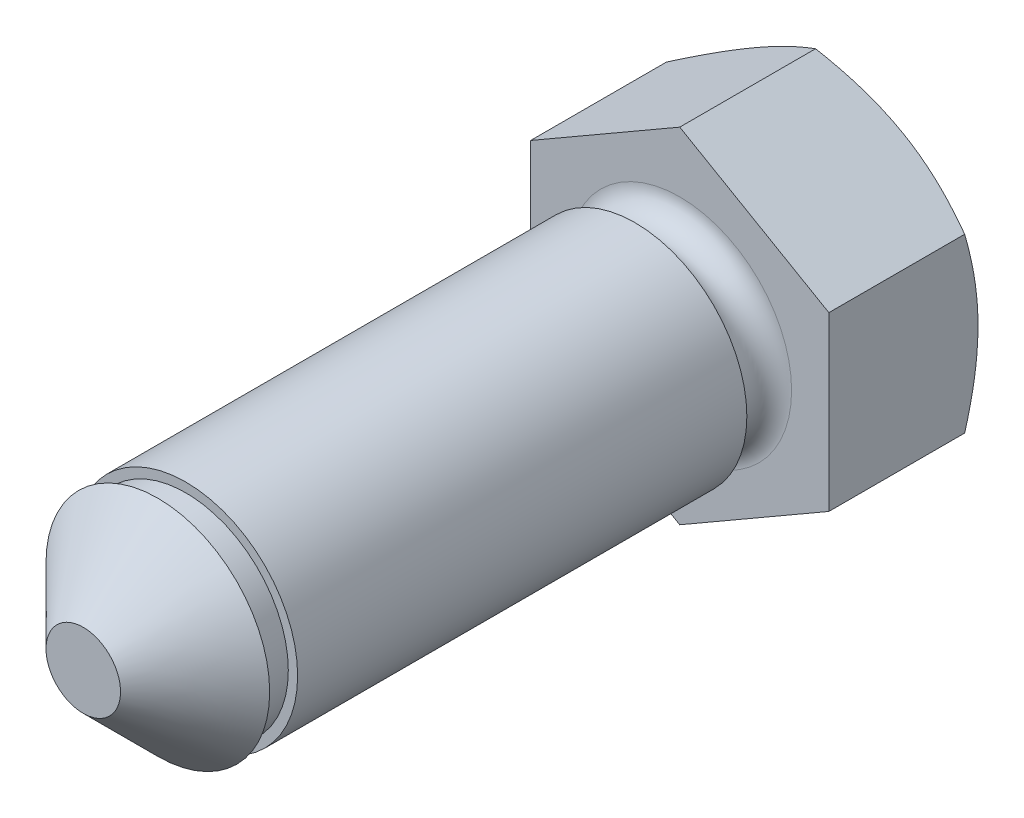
ISO-10303-21;
HEADER;
FILE_DESCRIPTION(('STEP AP214'),'2;1');
FILE_NAME('part.step','',(''),(''),'','','');
FILE_SCHEMA(('AUTOMOTIVE_DESIGN { 1 0 10303 214 1 1 1 1 }'));
ENDSEC;
DATA;
#1=APPLICATION_CONTEXT('core data for automotive mechanical design processes');
#2=APPLICATION_PROTOCOL_DEFINITION('international standard','automotive_design',2000,#1);
#3=PRODUCT_CONTEXT('',#1,'mechanical');
#4=PRODUCT('Part','Part','',(#3));
#5=PRODUCT_RELATED_PRODUCT_CATEGORY('part','',(#4));
#6=PRODUCT_DEFINITION_FORMATION('','',#4);
#7=PRODUCT_DEFINITION_CONTEXT('part definition',#1,'design');
#8=PRODUCT_DEFINITION('design','',#6,#7);
#9=PRODUCT_DEFINITION_SHAPE('','',#8);
#10=(LENGTH_UNIT() NAMED_UNIT(*) SI_UNIT(.MILLI.,.METRE.));
#11=(NAMED_UNIT(*) PLANE_ANGLE_UNIT() SI_UNIT($,.RADIAN.));
#12=(NAMED_UNIT(*) SI_UNIT($,.STERADIAN.) SOLID_ANGLE_UNIT());
#13=UNCERTAINTY_MEASURE_WITH_UNIT(LENGTH_MEASURE(1.E-05),#10,'distance_accuracy_value','');
#14=(GEOMETRIC_REPRESENTATION_CONTEXT(3) GLOBAL_UNCERTAINTY_ASSIGNED_CONTEXT((#13)) GLOBAL_UNIT_ASSIGNED_CONTEXT((#10,
#11,#12)) REPRESENTATION_CONTEXT('',''));
#15=CARTESIAN_POINT('',(0.,0.,0.));
#16=DIRECTION('',(0.,0.,1.));
#17=DIRECTION('',(1.,0.,0.));
#18=AXIS2_PLACEMENT_3D('',#15,#16,#17);
#19=CARTESIAN_POINT('',(0.,4.61880215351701,-4.));
#20=DIRECTION('',(0.499999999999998,0.86602540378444,0.));
#21=DIRECTION('',(-0.86602540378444,0.499999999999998,0.));
#22=AXIS2_PLACEMENT_3D('',#19,#20,#21);
#23=PLANE('',#22);
#24=CARTESIAN_POINT('',(-0.00020000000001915,4.61891762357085,-3.64266774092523));
#25=CARTESIAN_POINT('',(0.17557915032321,4.51743148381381,-3.70128212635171));
#26=CARTESIAN_POINT('',(0.352875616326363,4.41506932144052,-3.75458967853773));
#27=CARTESIAN_POINT('',(0.71053859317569,4.2085725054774,-3.84763832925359));
#28=CARTESIAN_POINT('',(0.890911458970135,4.10443418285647,-3.88734651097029));
#29=CARTESIAN_POINT('',(1.24942181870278,3.89744813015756,-3.94915778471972));
#30=CARTESIAN_POINT('',(1.42750415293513,3.7946322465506,-3.97167226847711));
#31=CARTESIAN_POINT('',(1.7845067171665,3.58851671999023,-3.99854937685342));
#32=CARTESIAN_POINT('',(1.96342564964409,3.48521782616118,-4.00293425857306));
#33=CARTESIAN_POINT('',(2.29774284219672,3.29219970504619,-3.99380992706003));
#34=CARTESIAN_POINT('',(2.45319115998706,3.20245157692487,-3.98254104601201));
#35=CARTESIAN_POINT('',(2.76307505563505,3.02354002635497,-3.94682600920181));
#36=CARTESIAN_POINT('',(2.91750956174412,2.93437722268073,-3.92236765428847));
#37=CARTESIAN_POINT('',(3.22803232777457,2.75509682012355,-3.86122393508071));
#38=CARTESIAN_POINT('',(3.3840812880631,2.66500191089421,-3.82427939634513));
#39=CARTESIAN_POINT('',(3.69385183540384,2.48615580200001,-3.74042992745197));
#40=CARTESIAN_POINT('',(3.84757739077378,2.39740231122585,-3.69354469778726));
#41=CARTESIAN_POINT('',(4.0002,2.30928560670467,-3.64266774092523));
#42=B_SPLINE_CURVE_WITH_KNOTS('',3,(#24,#25,#26,#27,#28,#29,#30,#31,#32,#33,#34,#35,#36,#37,#38,
#39,#40,#41),.UNSPECIFIED.,.F.,.F.,(4,2,2,2,2,2,2,2,4),(0.,0.634047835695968,1.26961969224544,
1.88946157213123,2.50854226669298,3.04757825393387,3.58711366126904,4.13861653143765,
4.68903648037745),.UNSPECIFIED.);
#43=CARTESIAN_POINT('',(0.,4.61880215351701,-3.64273441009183));
#44=VERTEX_POINT('',#43);
#45=CARTESIAN_POINT('',(1.99999999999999,3.46410161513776,-4.));
#46=VERTEX_POINT('',#45);
#47=EDGE_CURVE('E603',#44,#46,#42,.T.);
#48=ORIENTED_EDGE('',*,*,#47,.F.);
#49=DIRECTION('',(0.,0.,1.));
#50=VECTOR('',#49,1.);
#51=CARTESIAN_POINT('',(0.,4.61880215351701,-4.));
#52=LINE('',#51,#50);
#53=CARTESIAN_POINT('',(0.,4.61880215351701,0.));
#54=VERTEX_POINT('',#53);
#55=EDGE_CURVE('E579',#44,#54,#52,.T.);
#56=ORIENTED_EDGE('',*,*,#55,.T.);
#57=DIRECTION('',(-0.86602540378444,0.499999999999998,0.));
#58=VECTOR('',#57,1.);
#59=CARTESIAN_POINT('',(0.,4.61880215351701,0.));
#60=LINE('',#59,#58);
#61=CARTESIAN_POINT('',(4.,2.30940107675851,0.));
#62=VERTEX_POINT('',#61);
#63=EDGE_CURVE('E601',#62,#54,#60,.T.);
#64=ORIENTED_EDGE('',*,*,#63,.F.);
#65=DIRECTION('',(0.,0.,1.));
#66=VECTOR('',#65,1.);
#67=CARTESIAN_POINT('',(4.,2.30940107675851,-4.));
#68=LINE('',#67,#66);
#69=CARTESIAN_POINT('',(4.,2.30940107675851,-3.64273441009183));
#70=VERTEX_POINT('',#69);
#71=EDGE_CURVE('E575',#70,#62,#68,.T.);
#72=ORIENTED_EDGE('',*,*,#71,.F.);
#73=EDGE_CURVE('E495',#46,#70,#42,.T.);
#74=ORIENTED_EDGE('',*,*,#73,.F.);
#75=EDGE_LOOP('',(#48,#56,#64,#72,#74));
#76=FACE_BOUND('',#75,.T.);
#77=ADVANCED_FACE('F350',(#76),#23,.T.);
#78=CARTESIAN_POINT('',(4.,-2.30940107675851,-4.));
#79=DIRECTION('',(1.,0.,0.));
#80=DIRECTION('',(0.,1.,0.));
#81=AXIS2_PLACEMENT_3D('',#78,#79,#80);
#82=PLANE('',#81);
#83=CARTESIAN_POINT('',(4.,-6.2144707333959,-2.04248780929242));
#84=CARTESIAN_POINT('',(4.,-6.03961832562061,-2.12735161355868));
#85=CARTESIAN_POINT('',(4.,-5.86436561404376,-2.21140471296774));
#86=CARTESIAN_POINT('',(4.,-5.51284664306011,-2.37743358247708));
#87=CARTESIAN_POINT('',(4.,-5.33658022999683,-2.45940902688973));
#88=CARTESIAN_POINT('',(4.,-4.98191870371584,-2.62123640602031));
#89=CARTESIAN_POINT('',(4.,-4.8035172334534,-2.70107445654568));
#90=CARTESIAN_POINT('',(4.,-4.44529861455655,-2.85749647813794));
#91=CARTESIAN_POINT('',(4.,-4.26548153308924,-2.93408060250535));
#92=CARTESIAN_POINT('',(4.,-3.89840789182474,-3.08550256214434));
#93=CARTESIAN_POINT('',(4.,-3.71109634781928,-3.1602078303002));
#94=CARTESIAN_POINT('',(4.,-3.33428626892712,-3.30399127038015));
#95=CARTESIAN_POINT('',(4.,-3.14478749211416,-3.37306881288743));
#96=CARTESIAN_POINT('',(4.,-2.76365206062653,-3.503792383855));
#97=CARTESIAN_POINT('',(4.,-2.57202057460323,-3.56545333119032));
#98=CARTESIAN_POINT('',(4.,-2.18600937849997,-3.67937298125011));
#99=CARTESIAN_POINT('',(4.,-1.99163055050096,-3.73163463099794));
#100=CARTESIAN_POINT('',(4.,-1.6010395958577,-3.82399073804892));
#101=CARTESIAN_POINT('',(4.,-1.40484265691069,-3.86414824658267));
#102=CARTESIAN_POINT('',(4.,-1.00999836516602,-3.9300137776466));
#103=CARTESIAN_POINT('',(4.,-0.811351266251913,-3.95572328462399));
#104=CARTESIAN_POINT('',(4.,-0.415198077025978,-3.99030612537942));
#105=CARTESIAN_POINT('',(4.,-0.217711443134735,-3.99939684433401));
#106=CARTESIAN_POINT('',(4.,0.17733099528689,-4.00054431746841));
#107=CARTESIAN_POINT('',(4.,0.374886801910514,-3.99260050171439));
#108=CARTESIAN_POINT('',(4.,0.709857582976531,-3.96525154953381));
#109=CARTESIAN_POINT('',(4.,0.847630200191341,-3.94997310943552));
#110=CARTESIAN_POINT('',(4.,1.1221689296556,-3.91207564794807));
#111=CARTESIAN_POINT('',(4.,1.25893490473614,-3.88945564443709));
#112=CARTESIAN_POINT('',(4.,1.66753166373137,-3.81177225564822));
#113=CARTESIAN_POINT('',(4.,1.93751819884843,-3.74689872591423));
#114=CARTESIAN_POINT('',(4.,2.34141488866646,-3.6343389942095));
#115=CARTESIAN_POINT('',(4.,2.47741402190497,-3.59372208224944));
#116=CARTESIAN_POINT('',(4.,2.74809025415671,-3.50826048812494));
#117=CARTESIAN_POINT('',(4.,2.88276734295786,-3.46341577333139));
#118=CARTESIAN_POINT('',(4.,3.15084486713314,-3.37021924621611));
#119=CARTESIAN_POINT('',(4.,3.28424568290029,-3.32186851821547));
#120=CARTESIAN_POINT('',(4.,3.54993863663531,-3.22222993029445));
#121=CARTESIAN_POINT('',(4.,3.68223080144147,-3.17094214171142));
#122=CARTESIAN_POINT('',(4.,4.046954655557,-3.02563622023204));
#123=CARTESIAN_POINT('',(4.,4.27835104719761,-2.92902165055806));
#124=CARTESIAN_POINT('',(4.,4.73873215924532,-2.73018785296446));
#125=CARTESIAN_POINT('',(4.,4.96771659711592,-2.62796797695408));
#126=CARTESIAN_POINT('',(4.,5.42384244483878,-2.41929757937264));
#127=CARTESIAN_POINT('',(4.,5.65098316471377,-2.31284555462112));
#128=CARTESIAN_POINT('',(4.,6.10374131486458,-2.09674332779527));
#129=CARTESIAN_POINT('',(4.,6.3293586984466,-1.98709302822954));
#130=CARTESIAN_POINT('',(4.,6.77972688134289,-1.76514036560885));
#131=CARTESIAN_POINT('',(4.,7.00447574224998,-1.65283407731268));
#132=CARTESIAN_POINT('',(4.,7.45298330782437,-1.42625944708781));
#133=CARTESIAN_POINT('',(4.,7.67674200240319,-1.31199108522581));
#134=CARTESIAN_POINT('',(4.,8.34671424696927,-0.966909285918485));
#135=CARTESIAN_POINT('',(4.,8.79172789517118,-0.733767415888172));
#136=CARTESIAN_POINT('',(4.,9.63103051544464,-0.289093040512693));
#137=CARTESIAN_POINT('',(4.,10.0255454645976,-0.0779850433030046));
#138=CARTESIAN_POINT('',(4.,10.8133186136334,0.346621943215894));
#139=CARTESIAN_POINT('',(4.,11.2065767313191,0.560121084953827));
#140=CARTESIAN_POINT('',(4.,11.9908278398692,0.988169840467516));
#141=CARTESIAN_POINT('',(4.,12.3818240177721,1.20271362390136));
#142=CARTESIAN_POINT('',(4.,13.1630345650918,1.63314694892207));
#143=CARTESIAN_POINT('',(4.,13.5532489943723,1.84903638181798));
#144=CARTESIAN_POINT('',(4.,13.9431910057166,2.0654138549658));
#145=B_SPLINE_CURVE_WITH_KNOTS('',3,(#83,#84,#85,#86,#87,#88,#89,#90,#91,#92,#93,#94,#95,#96,
#97,#98,#99,#100,#101,#102,#103,#104,#105,#106,#107,#108,#109,#110,#111,#112,#113,#114,#115,
#116,#117,#118,#119,#120,#121,#122,#123,#124,#125,#126,#127,#128,#129,#130,#131,#132,#133,#134,
#135,#136,#137,#138,#139,#140,#141,#142,#143,#144),.UNSPECIFIED.,.F.,.F.,(4,2,2,2,2,2,2,2,2,2,2,
2,2,2,2,2,2,2,2,2,2,2,2,2,2,2,2,2,2,2,4),(0.,0.583082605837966,1.16625605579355,
1.75258384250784,2.33888397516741,2.94379211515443,3.54876781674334,4.15250547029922,
4.75605349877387,5.35640100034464,5.95668680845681,6.54906268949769,7.14145839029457,
7.55710878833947,7.97281481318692,8.80465598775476,9.23042410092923,9.65619550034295,
10.0818357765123,10.5074657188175,11.2596212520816,12.0118639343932,12.7643762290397,
13.5169114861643,14.2706385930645,15.0243733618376,16.5314946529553,17.8738267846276,
19.2162449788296,20.554212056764,21.8920724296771),.UNSPECIFIED.);
#146=CARTESIAN_POINT('',(4.,0.,-4.));
#147=VERTEX_POINT('',#146);
#148=EDGE_CURVE('E493',#70,#147,#145,.F.);
#149=ORIENTED_EDGE('',*,*,#148,.F.);
#150=ORIENTED_EDGE('',*,*,#71,.T.);
#151=DIRECTION('',(0.,1.,0.));
#152=VECTOR('',#151,1.);
#153=CARTESIAN_POINT('',(4.,-2.30940107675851,0.));
#154=LINE('',#153,#152);
#155=CARTESIAN_POINT('',(4.,-2.30940107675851,0.));
#156=VERTEX_POINT('',#155);
#157=EDGE_CURVE('E581',#156,#62,#154,.T.);
#158=ORIENTED_EDGE('',*,*,#157,.F.);
#159=DIRECTION('',(0.,0.,1.));
#160=VECTOR('',#159,1.);
#161=CARTESIAN_POINT('',(4.,-2.30940107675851,-4.));
#162=LINE('',#161,#160);
#163=CARTESIAN_POINT('',(4.,-2.30940107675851,-3.64273441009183));
#164=VERTEX_POINT('',#163);
#165=EDGE_CURVE('E576',#164,#156,#162,.T.);
#166=ORIENTED_EDGE('',*,*,#165,.F.);
#167=EDGE_CURVE('E488',#147,#164,#145,.F.);
#168=ORIENTED_EDGE('',*,*,#167,.F.);
#169=EDGE_LOOP('',(#149,#150,#158,#166,#168));
#170=FACE_BOUND('',#169,.T.);
#171=ADVANCED_FACE('F501',(#170),#82,.T.);
#172=CARTESIAN_POINT('',(0.,-4.61880215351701,-4.));
#173=DIRECTION('',(0.499999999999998,-0.86602540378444,0.));
#174=DIRECTION('',(0.86602540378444,0.499999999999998,0.));
#175=AXIS2_PLACEMENT_3D('',#172,#173,#174);
#176=PLANE('',#175);
#177=CARTESIAN_POINT('',(4.0002,-2.30928560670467,-3.64266774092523));
#178=CARTESIAN_POINT('',(3.82442084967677,-2.41077174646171,-3.70128212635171));
#179=CARTESIAN_POINT('',(3.64712438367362,-2.513133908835,-3.75458967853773));
#180=CARTESIAN_POINT('',(3.28946140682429,-2.71963072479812,-3.84763832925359));
#181=CARTESIAN_POINT('',(3.10908854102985,-2.82376904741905,-3.88734651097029));
#182=CARTESIAN_POINT('',(2.75057818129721,-3.03075510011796,-3.94915778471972));
#183=CARTESIAN_POINT('',(2.57249584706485,-3.13357098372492,-3.97167226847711));
#184=CARTESIAN_POINT('',(2.21549328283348,-3.33968651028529,-3.99854937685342));
#185=CARTESIAN_POINT('',(2.03657435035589,-3.44298540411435,-4.00293425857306));
#186=CARTESIAN_POINT('',(1.70225715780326,-3.63600352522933,-3.99380992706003));
#187=CARTESIAN_POINT('',(1.54680884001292,-3.72575165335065,-3.98254104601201));
#188=CARTESIAN_POINT('',(1.23692494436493,-3.90466320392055,-3.94682600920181));
#189=CARTESIAN_POINT('',(1.08249043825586,-3.99382600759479,-3.92236765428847));
#190=CARTESIAN_POINT('',(0.771967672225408,-4.17310641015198,-3.86122393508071));
#191=CARTESIAN_POINT('',(0.615918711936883,-4.26320131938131,-3.82427939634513));
#192=CARTESIAN_POINT('',(0.306148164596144,-4.44204742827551,-3.74042992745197));
#193=CARTESIAN_POINT('',(0.152422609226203,-4.53080091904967,-3.69354469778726));
#194=CARTESIAN_POINT('',(-0.000200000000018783,-4.61891762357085,-3.64266774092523));
#195=B_SPLINE_CURVE_WITH_KNOTS('',3,(#177,#178,#179,#180,#181,#182,#183,#184,#185,#186,#187,
#188,#189,#190,#191,#192,#193,#194),.UNSPECIFIED.,.F.,.F.,(4,2,2,2,2,2,2,2,4),(0.,
0.634047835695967,1.26961969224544,1.88946157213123,2.50854226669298,3.04757825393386,
3.58711366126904,4.13861653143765,4.68903648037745),.UNSPECIFIED.);
#196=CARTESIAN_POINT('',(1.99999999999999,-3.46410161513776,-4.));
#197=VERTEX_POINT('',#196);
#198=EDGE_CURVE('E494',#164,#197,#195,.T.);
#199=ORIENTED_EDGE('',*,*,#198,.F.);
#200=ORIENTED_EDGE('',*,*,#165,.T.);
#201=DIRECTION('',(0.86602540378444,0.499999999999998,0.));
#202=VECTOR('',#201,1.);
#203=CARTESIAN_POINT('',(0.,-4.61880215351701,0.));
#204=LINE('',#203,#202);
#205=CARTESIAN_POINT('',(0.,-4.61880215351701,0.));
#206=VERTEX_POINT('',#205);
#207=EDGE_CURVE('E590',#206,#156,#204,.T.);
#208=ORIENTED_EDGE('',*,*,#207,.F.);
#209=DIRECTION('',(0.,0.,1.));
#210=VECTOR('',#209,1.);
#211=CARTESIAN_POINT('',(0.,-4.61880215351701,-4.));
#212=LINE('',#211,#210);
#213=CARTESIAN_POINT('',(0.,-4.61880215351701,-3.64273441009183));
#214=VERTEX_POINT('',#213);
#215=EDGE_CURVE('E585',#214,#206,#212,.T.);
#216=ORIENTED_EDGE('',*,*,#215,.F.);
#217=EDGE_CURVE('E482',#197,#214,#195,.T.);
#218=ORIENTED_EDGE('',*,*,#217,.F.);
#219=EDGE_LOOP('',(#199,#200,#208,#216,#218));
#220=FACE_BOUND('',#219,.T.);
#221=ADVANCED_FACE('F504',(#220),#176,.T.);
#222=CARTESIAN_POINT('',(0.,-4.61880215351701,-4.));
#223=DIRECTION('',(-0.500000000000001,-0.866025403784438,0.));
#224=DIRECTION('',(0.866025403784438,-0.500000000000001,0.));
#225=AXIS2_PLACEMENT_3D('',#222,#223,#224);
#226=PLANE('',#225);
#227=CARTESIAN_POINT('',(0.000199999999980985,-4.61891762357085,-3.64266774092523));
#228=CARTESIAN_POINT('',(-0.175579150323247,-4.51743148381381,-3.70128212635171));
#229=CARTESIAN_POINT('',(-0.3528756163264,-4.41506932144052,-3.75458967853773));
#230=CARTESIAN_POINT('',(-0.710538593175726,-4.2085725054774,-3.84763832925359));
#231=CARTESIAN_POINT('',(-0.890911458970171,-4.10443418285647,-3.88734651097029));
#232=CARTESIAN_POINT('',(-1.24942181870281,-3.89744813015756,-3.94915778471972));
#233=CARTESIAN_POINT('',(-1.42750415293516,-3.79463224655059,-3.97167226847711));
#234=CARTESIAN_POINT('',(-1.78450671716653,-3.58851671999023,-3.99854937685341));
#235=CARTESIAN_POINT('',(-1.96342564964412,-3.48521782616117,-4.00293425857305));
#236=CARTESIAN_POINT('',(-2.29774284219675,-3.29219970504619,-3.99380992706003));
#237=CARTESIAN_POINT('',(-2.45319115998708,-3.20245157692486,-3.982541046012));
#238=CARTESIAN_POINT('',(-2.76307505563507,-3.02354002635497,-3.9468260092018));
#239=CARTESIAN_POINT('',(-2.91750956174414,-2.93437722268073,-3.92236765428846));
#240=CARTESIAN_POINT('',(-3.22803232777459,-2.75509682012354,-3.86122393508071));
#241=CARTESIAN_POINT('',(-3.38408128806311,-2.6650019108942,-3.82427939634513));
#242=CARTESIAN_POINT('',(-3.69385183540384,-2.48615580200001,-3.74042992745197));
#243=CARTESIAN_POINT('',(-3.84757739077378,-2.39740231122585,-3.69354469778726));
#244=CARTESIAN_POINT('',(-4.0002,-2.30928560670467,-3.64266774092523));
#245=B_SPLINE_CURVE_WITH_KNOTS('',3,(#227,#228,#229,#230,#231,#232,#233,#234,#235,#236,#237,
#238,#239,#240,#241,#242,#243,#244),.UNSPECIFIED.,.F.,.F.,(4,2,2,2,2,2,2,2,4),(0.,
0.634047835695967,1.26961969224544,1.88946157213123,2.50854226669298,3.04757825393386,
3.58711366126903,4.13861653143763,4.68903648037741),.UNSPECIFIED.);
#246=CARTESIAN_POINT('',(-2.,-3.46410161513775,-4.));
#247=VERTEX_POINT('',#246);
#248=EDGE_CURVE('E621',#214,#247,#245,.T.);
#249=ORIENTED_EDGE('',*,*,#248,.F.);
#250=ORIENTED_EDGE('',*,*,#215,.T.);
#251=DIRECTION('',(0.866025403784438,-0.500000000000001,0.));
#252=VECTOR('',#251,1.);
#253=CARTESIAN_POINT('',(0.,-4.61880215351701,0.));
#254=LINE('',#253,#252);
#255=CARTESIAN_POINT('',(-4.,-2.30940107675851,0.));
#256=VERTEX_POINT('',#255);
#257=EDGE_CURVE('E593',#256,#206,#254,.T.);
#258=ORIENTED_EDGE('',*,*,#257,.F.);
#259=DIRECTION('',(0.,0.,1.));
#260=VECTOR('',#259,1.);
#261=CARTESIAN_POINT('',(-4.,-2.30940107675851,-4.));
#262=LINE('',#261,#260);
#263=CARTESIAN_POINT('',(-4.,-2.30940107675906,-3.6427344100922));
#264=VERTEX_POINT('',#263);
#265=EDGE_CURVE('E583',#264,#256,#262,.T.);
#266=ORIENTED_EDGE('',*,*,#265,.F.);
#267=EDGE_CURVE('E427',#247,#264,#245,.T.);
#268=ORIENTED_EDGE('',*,*,#267,.F.);
#269=EDGE_LOOP('',(#249,#250,#258,#266,#268));
#270=FACE_BOUND('',#269,.T.);
#271=ADVANCED_FACE('F508',(#270),#226,.T.);
#272=CARTESIAN_POINT('',(-4.,-2.30940107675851,-4.));
#273=DIRECTION('',(-1.,0.,0.));
#274=DIRECTION('',(0.,0.,1.));
#275=AXIS2_PLACEMENT_3D('',#272,#273,#274);
#276=PLANE('',#275);
#277=CARTESIAN_POINT('',(-4.,-6.21447073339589,-2.04248780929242));
#278=CARTESIAN_POINT('',(-4.,-6.0396183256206,-2.12735161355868));
#279=CARTESIAN_POINT('',(-4.,-5.86436561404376,-2.21140471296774));
#280=CARTESIAN_POINT('',(-4.,-5.51284664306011,-2.37743358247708));
#281=CARTESIAN_POINT('',(-4.,-5.33658022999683,-2.45940902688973));
#282=CARTESIAN_POINT('',(-4.,-4.98191870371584,-2.62123640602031));
#283=CARTESIAN_POINT('',(-4.,-4.8035172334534,-2.70107445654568));
#284=CARTESIAN_POINT('',(-4.,-4.44529861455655,-2.85749647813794));
#285=CARTESIAN_POINT('',(-4.,-4.26548153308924,-2.93408060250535));
#286=CARTESIAN_POINT('',(-4.,-3.89840789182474,-3.08550256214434));
#287=CARTESIAN_POINT('',(-4.,-3.71109634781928,-3.1602078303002));
#288=CARTESIAN_POINT('',(-4.,-3.33428626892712,-3.30399127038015));
#289=CARTESIAN_POINT('',(-4.,-3.14478749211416,-3.37306881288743));
#290=CARTESIAN_POINT('',(-4.,-2.76365206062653,-3.503792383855));
#291=CARTESIAN_POINT('',(-4.,-2.57202057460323,-3.56545333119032));
#292=CARTESIAN_POINT('',(-4.,-2.18600937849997,-3.67937298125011));
#293=CARTESIAN_POINT('',(-4.,-1.99163055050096,-3.73163463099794));
#294=CARTESIAN_POINT('',(-4.,-1.6010395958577,-3.82399073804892));
#295=CARTESIAN_POINT('',(-4.,-1.40484265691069,-3.86414824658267));
#296=CARTESIAN_POINT('',(-4.,-1.00999836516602,-3.9300137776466));
#297=CARTESIAN_POINT('',(-4.,-0.811351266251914,-3.95572328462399));
#298=CARTESIAN_POINT('',(-4.,-0.415198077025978,-3.99030612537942));
#299=CARTESIAN_POINT('',(-4.,-0.217711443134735,-3.99939684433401));
#300=CARTESIAN_POINT('',(-4.,0.17733099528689,-4.00054431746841));
#301=CARTESIAN_POINT('',(-4.,0.374886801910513,-3.99260050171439));
#302=CARTESIAN_POINT('',(-4.,0.70985758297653,-3.96525154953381));
#303=CARTESIAN_POINT('',(-4.,0.84763020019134,-3.94997310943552));
#304=CARTESIAN_POINT('',(-4.,1.1221689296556,-3.91207564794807));
#305=CARTESIAN_POINT('',(-4.,1.25893490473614,-3.88945564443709));
#306=CARTESIAN_POINT('',(-4.,1.66753166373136,-3.81177225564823));
#307=CARTESIAN_POINT('',(-4.,1.93751819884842,-3.74689872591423));
#308=CARTESIAN_POINT('',(-4.,2.34141488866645,-3.6343389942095));
#309=CARTESIAN_POINT('',(-4.,2.47741402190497,-3.59372208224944));
#310=CARTESIAN_POINT('',(-4.,2.74809025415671,-3.50826048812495));
#311=CARTESIAN_POINT('',(-4.,2.88276734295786,-3.46341577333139));
#312=CARTESIAN_POINT('',(-4.,3.15084486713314,-3.37021924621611));
#313=CARTESIAN_POINT('',(-4.,3.28424568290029,-3.32186851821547));
#314=CARTESIAN_POINT('',(-4.,3.54993863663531,-3.22222993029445));
#315=CARTESIAN_POINT('',(-4.,3.68223080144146,-3.17094214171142));
#316=CARTESIAN_POINT('',(-4.,4.046954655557,-3.02563622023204));
#317=CARTESIAN_POINT('',(-4.,4.2783510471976,-2.92902165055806));
#318=CARTESIAN_POINT('',(-4.,4.73873215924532,-2.73018785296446));
#319=CARTESIAN_POINT('',(-4.,4.96771659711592,-2.62796797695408));
#320=CARTESIAN_POINT('',(-4.,5.42384244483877,-2.41929757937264));
#321=CARTESIAN_POINT('',(-4.,5.65098316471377,-2.31284555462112));
#322=CARTESIAN_POINT('',(-4.,6.10374131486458,-2.09674332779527));
#323=CARTESIAN_POINT('',(-4.,6.3293586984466,-1.98709302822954));
#324=CARTESIAN_POINT('',(-4.,6.77972688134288,-1.76514036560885));
#325=CARTESIAN_POINT('',(-4.,7.00447574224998,-1.65283407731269));
#326=CARTESIAN_POINT('',(-4.,7.45298330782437,-1.42625944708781));
#327=CARTESIAN_POINT('',(-4.,7.67674200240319,-1.31199108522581));
#328=CARTESIAN_POINT('',(-4.,8.34671424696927,-0.966909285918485));
#329=CARTESIAN_POINT('',(-4.,8.79172789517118,-0.733767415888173));
#330=CARTESIAN_POINT('',(-4.,9.63103051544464,-0.289093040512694));
#331=CARTESIAN_POINT('',(-4.,10.0255454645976,-0.0779850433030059));
#332=CARTESIAN_POINT('',(-4.,10.8133186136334,0.346621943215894));
#333=CARTESIAN_POINT('',(-4.,11.2065767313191,0.560121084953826));
#334=CARTESIAN_POINT('',(-4.,11.9908278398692,0.988169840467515));
#335=CARTESIAN_POINT('',(-4.,12.3818240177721,1.20271362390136));
#336=CARTESIAN_POINT('',(-4.,13.1630345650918,1.63314694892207));
#337=CARTESIAN_POINT('',(-4.,13.5532489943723,1.84903638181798));
#338=CARTESIAN_POINT('',(-4.,13.9431910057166,2.0654138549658));
#339=B_SPLINE_CURVE_WITH_KNOTS('',3,(#277,#278,#279,#280,#281,#282,#283,#284,#285,#286,#287,
#288,#289,#290,#291,#292,#293,#294,#295,#296,#297,#298,#299,#300,#301,#302,#303,#304,#305,#306,
#307,#308,#309,#310,#311,#312,#313,#314,#315,#316,#317,#318,#319,#320,#321,#322,#323,#324,#325,
#326,#327,#328,#329,#330,#331,#332,#333,#334,#335,#336,#337,#338),.UNSPECIFIED.,.F.,.F.,(4,2,2,
2,2,2,2,2,2,2,2,2,2,2,2,2,2,2,2,2,2,2,2,2,2,2,2,2,2,2,4),(0.,0.583082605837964,1.16625605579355,
1.75258384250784,2.3388839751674,2.94379211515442,3.54876781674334,4.15250547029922,
4.75605349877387,5.35640100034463,5.95668680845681,6.54906268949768,7.14145839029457,
7.55710878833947,7.97281481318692,8.80465598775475,9.23042410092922,9.65619550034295,
10.0818357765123,10.5074657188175,11.2596212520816,12.0118639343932,12.7643762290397,
13.5169114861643,14.2706385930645,15.0243733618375,16.5314946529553,17.8738267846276,
19.2162449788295,20.554212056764,21.8920724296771),.UNSPECIFIED.);
#340=CARTESIAN_POINT('',(-4.,0.,-4.));
#341=VERTEX_POINT('',#340);
#342=EDGE_CURVE('E422',#264,#341,#339,.T.);
#343=ORIENTED_EDGE('',*,*,#342,.F.);
#344=ORIENTED_EDGE('',*,*,#265,.T.);
#345=DIRECTION('',(0.,-1.,0.));
#346=VECTOR('',#345,1.);
#347=CARTESIAN_POINT('',(-4.,-2.30940107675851,0.));
#348=LINE('',#347,#346);
#349=CARTESIAN_POINT('',(-4.,2.30940107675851,0.));
#350=VERTEX_POINT('',#349);
#351=EDGE_CURVE('E596',#350,#256,#348,.T.);
#352=ORIENTED_EDGE('',*,*,#351,.F.);
#353=DIRECTION('',(0.,0.,1.));
#354=VECTOR('',#353,1.);
#355=CARTESIAN_POINT('',(-4.,2.30940107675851,-4.));
#356=LINE('',#355,#354);
#357=CARTESIAN_POINT('',(-4.,2.30940107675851,-3.64273441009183));
#358=VERTEX_POINT('',#357);
#359=EDGE_CURVE('E449',#358,#350,#356,.T.);
#360=ORIENTED_EDGE('',*,*,#359,.F.);
#361=EDGE_CURVE('E431',#341,#358,#339,.T.);
#362=ORIENTED_EDGE('',*,*,#361,.F.);
#363=EDGE_LOOP('',(#343,#344,#352,#360,#362));
#364=FACE_BOUND('',#363,.T.);
#365=ADVANCED_FACE('F447',(#364),#276,.T.);
#366=CARTESIAN_POINT('',(-4.,2.30940107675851,-4.));
#367=DIRECTION('',(-0.500000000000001,0.866025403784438,0.));
#368=DIRECTION('',(-0.866025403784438,-0.500000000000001,0.));
#369=AXIS2_PLACEMENT_3D('',#366,#367,#368);
#370=PLANE('',#369);
#371=CARTESIAN_POINT('',(-4.0002,2.30928560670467,-3.64266774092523));
#372=CARTESIAN_POINT('',(-3.82442084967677,2.41077174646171,-3.70128212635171));
#373=CARTESIAN_POINT('',(-3.64712438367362,2.513133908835,-3.75458967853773));
#374=CARTESIAN_POINT('',(-3.28946140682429,2.71963072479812,-3.84763832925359));
#375=CARTESIAN_POINT('',(-3.10908854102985,2.82376904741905,-3.88734651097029));
#376=CARTESIAN_POINT('',(-2.75057818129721,3.03075510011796,-3.94915778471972));
#377=CARTESIAN_POINT('',(-2.57249584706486,3.13357098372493,-3.97167226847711));
#378=CARTESIAN_POINT('',(-2.21549328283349,3.33968651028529,-3.99854937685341));
#379=CARTESIAN_POINT('',(-2.0365743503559,3.44298540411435,-4.00293425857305));
#380=CARTESIAN_POINT('',(-1.70225715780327,3.63600352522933,-3.99380992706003));
#381=CARTESIAN_POINT('',(-1.54680884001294,3.72575165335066,-3.982541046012));
#382=CARTESIAN_POINT('',(-1.23692494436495,3.90466320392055,-3.9468260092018));
#383=CARTESIAN_POINT('',(-1.08249043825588,3.99382600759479,-3.92236765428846));
#384=CARTESIAN_POINT('',(-0.771967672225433,4.17310641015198,-3.86122393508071));
#385=CARTESIAN_POINT('',(-0.615918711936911,4.26320131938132,-3.82427939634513));
#386=CARTESIAN_POINT('',(-0.306148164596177,4.44204742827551,-3.74042992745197));
#387=CARTESIAN_POINT('',(-0.152422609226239,4.53080091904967,-3.69354469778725));
#388=CARTESIAN_POINT('',(0.00019999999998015,4.61891762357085,-3.64266774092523));
#389=B_SPLINE_CURVE_WITH_KNOTS('',3,(#371,#372,#373,#374,#375,#376,#377,#378,#379,#380,#381,
#382,#383,#384,#385,#386,#387,#388),.UNSPECIFIED.,.F.,.F.,(4,2,2,2,2,2,2,2,4),(0.,
0.634047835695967,1.26961969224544,1.88946157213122,2.50854226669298,3.04757825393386,
3.58711366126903,4.13861653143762,4.68903648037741),.UNSPECIFIED.);
#390=CARTESIAN_POINT('',(-2.00000000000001,3.46410161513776,-4.));
#391=VERTEX_POINT('',#390);
#392=EDGE_CURVE('E437',#358,#391,#389,.T.);
#393=ORIENTED_EDGE('',*,*,#392,.F.);
#394=ORIENTED_EDGE('',*,*,#359,.T.);
#395=DIRECTION('',(-0.866025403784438,-0.500000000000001,0.));
#396=VECTOR('',#395,1.);
#397=CARTESIAN_POINT('',(-4.,2.30940107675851,0.));
#398=LINE('',#397,#396);
#399=EDGE_CURVE('E599',#54,#350,#398,.T.);
#400=ORIENTED_EDGE('',*,*,#399,.F.);
#401=ORIENTED_EDGE('',*,*,#55,.F.);
#402=EDGE_CURVE('E439',#391,#44,#389,.T.);
#403=ORIENTED_EDGE('',*,*,#402,.F.);
#404=EDGE_LOOP('',(#393,#394,#400,#401,#403));
#405=FACE_BOUND('',#404,.T.);
#406=ADVANCED_FACE('F516',(#405),#370,.T.);
#407=CARTESIAN_POINT('',(4.,2.30940107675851,0.));
#408=DIRECTION('',(0.,0.,1.));
#409=DIRECTION('',(1.,0.,0.));
#410=AXIS2_PLACEMENT_3D('',#407,#408,#409);
#411=PLANE('',#410);
#412=CARTESIAN_POINT('',(0.,0.,0.));
#413=DIRECTION('',(0.,0.,-1.));
#414=DIRECTION('',(-1.,0.,0.));
#415=AXIS2_PLACEMENT_3D('',#412,#413,#414);
#416=CIRCLE('',#415,3.);
#417=CARTESIAN_POINT('',(-3.,0.,0.));
#418=VERTEX_POINT('',#417);
#419=EDGE_CURVE('E546',#418,#418,#416,.T.);
#420=ORIENTED_EDGE('',*,*,#419,.T.);
#421=EDGE_LOOP('',(#420));
#422=FACE_BOUND('',#421,.T.);
#423=ORIENTED_EDGE('',*,*,#63,.T.);
#424=ORIENTED_EDGE('',*,*,#399,.T.);
#425=ORIENTED_EDGE('',*,*,#351,.T.);
#426=ORIENTED_EDGE('',*,*,#257,.T.);
#427=ORIENTED_EDGE('',*,*,#207,.T.);
#428=ORIENTED_EDGE('',*,*,#157,.T.);
#429=EDGE_LOOP('',(#423,#424,#425,#426,#427,#428));
#430=FACE_BOUND('',#429,.T.);
#431=ADVANCED_FACE('F474',(#422,#430),#411,.T.);
#432=CARTESIAN_POINT('',(0.,0.,0.));
#433=DIRECTION('',(0.,0.,1.));
#434=DIRECTION('',(1.,0.,0.));
#435=AXIS2_PLACEMENT_3D('',#432,#433,#434);
#436=CONICAL_SURFACE('',#435,10.9282032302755,1.0471975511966);
#437=ORIENTED_EDGE('',*,*,#73,.T.);
#438=ORIENTED_EDGE('',*,*,#148,.T.);
#439=CARTESIAN_POINT('',(0.,0.,-4.));
#440=DIRECTION('',(0.,0.,1.));
#441=DIRECTION('',(1.,0.,0.));
#442=AXIS2_PLACEMENT_3D('',#439,#440,#441);
#443=CIRCLE('',#442,4.);
#444=EDGE_CURVE('E354',#46,#147,#443,.F.);
#445=ORIENTED_EDGE('',*,*,#444,.F.);
#446=EDGE_LOOP('',(#437,#438,#445));
#447=FACE_BOUND('',#446,.T.);
#448=ADVANCED_FACE('F611',(#447),#436,.T.);
#449=ORIENTED_EDGE('',*,*,#47,.T.);
#450=EDGE_CURVE('E445',#391,#46,#443,.F.);
#451=ORIENTED_EDGE('',*,*,#450,.F.);
#452=ORIENTED_EDGE('',*,*,#402,.T.);
#453=EDGE_LOOP('',(#449,#451,#452));
#454=FACE_BOUND('',#453,.T.);
#455=ADVANCED_FACE('F471',(#454),#436,.T.);
#456=ORIENTED_EDGE('',*,*,#361,.T.);
#457=ORIENTED_EDGE('',*,*,#392,.T.);
#458=CARTESIAN_POINT('',(0.,0.,-4.));
#459=DIRECTION('',(0.,0.,-1.));
#460=DIRECTION('',(-1.,0.,0.));
#461=AXIS2_PLACEMENT_3D('',#458,#459,#460);
#462=CIRCLE('',#461,4.);
#463=EDGE_CURVE('E372',#341,#391,#462,.T.);
#464=ORIENTED_EDGE('',*,*,#463,.F.);
#465=EDGE_LOOP('',(#456,#457,#464));
#466=FACE_BOUND('',#465,.T.);
#467=ADVANCED_FACE('F435',(#466),#436,.T.);
#468=ORIENTED_EDGE('',*,*,#267,.T.);
#469=ORIENTED_EDGE('',*,*,#342,.T.);
#470=EDGE_CURVE('E424',#247,#341,#443,.F.);
#471=ORIENTED_EDGE('',*,*,#470,.F.);
#472=EDGE_LOOP('',(#468,#469,#471));
#473=FACE_BOUND('',#472,.T.);
#474=ADVANCED_FACE('F423',(#473),#436,.T.);
#475=ORIENTED_EDGE('',*,*,#217,.T.);
#476=ORIENTED_EDGE('',*,*,#248,.T.);
#477=EDGE_CURVE('E359',#197,#247,#443,.F.);
#478=ORIENTED_EDGE('',*,*,#477,.F.);
#479=EDGE_LOOP('',(#475,#476,#478));
#480=FACE_BOUND('',#479,.T.);
#481=ADVANCED_FACE('F623',(#480),#436,.T.);
#482=ORIENTED_EDGE('',*,*,#167,.T.);
#483=ORIENTED_EDGE('',*,*,#198,.T.);
#484=EDGE_CURVE('E11',#147,#197,#443,.F.);
#485=ORIENTED_EDGE('',*,*,#484,.F.);
#486=EDGE_LOOP('',(#482,#483,#485));
#487=FACE_BOUND('',#486,.T.);
#488=ADVANCED_FACE('F618',(#487),#436,.T.);
#489=CARTESIAN_POINT('',(4.,2.30940107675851,-4.));
#490=DIRECTION('',(0.,0.,1.));
#491=DIRECTION('',(1.,0.,0.));
#492=AXIS2_PLACEMENT_3D('',#489,#490,#491);
#493=PLANE('',#492);
#494=ORIENTED_EDGE('',*,*,#444,.T.);
#495=ORIENTED_EDGE('',*,*,#484,.T.);
#496=ORIENTED_EDGE('',*,*,#477,.T.);
#497=ORIENTED_EDGE('',*,*,#470,.T.);
#498=ORIENTED_EDGE('',*,*,#463,.T.);
#499=ORIENTED_EDGE('',*,*,#450,.T.);
#500=EDGE_LOOP('',(#494,#495,#496,#497,#498,#499));
#501=FACE_BOUND('',#500,.T.);
#502=ADVANCED_FACE('F443',(#501),#493,.F.);
#503=CARTESIAN_POINT('',(0.,0.,0.6));
#504=DIRECTION('',(0.,0.,-1.));
#505=DIRECTION('',(-1.,0.,0.));
#506=AXIS2_PLACEMENT_3D('',#503,#504,#505);
#507=TOROIDAL_SURFACE('',#506,3.,0.6);
#508=CARTESIAN_POINT('',(0.,0.,1.2));
#509=DIRECTION('',(0.,0.,-1.));
#510=DIRECTION('',(-1.,0.,0.));
#511=AXIS2_PLACEMENT_3D('',#508,#509,#510);
#512=CIRCLE('',#511,3.);
#513=CARTESIAN_POINT('',(-3.,0.,1.2));
#514=VERTEX_POINT('',#513);
#515=EDGE_CURVE('E440',#514,#514,#512,.T.);
#516=ORIENTED_EDGE('',*,*,#515,.T.);
#517=EDGE_LOOP('',(#516));
#518=FACE_BOUND('',#517,.T.);
#519=ORIENTED_EDGE('',*,*,#419,.F.);
#520=EDGE_LOOP('',(#519));
#521=FACE_BOUND('',#520,.T.);
#522=ADVANCED_FACE('F472',(#518,#521),#507,.F.);
#523=CARTESIAN_POINT('',(0.,0.,0.));
#524=DIRECTION('',(0.,0.,1.));
#525=DIRECTION('',(1.,0.,0.));
#526=AXIS2_PLACEMENT_3D('',#523,#524,#525);
#527=CYLINDRICAL_SURFACE('',#526,3.);
#528=CARTESIAN_POINT('',(0.,0.,13.25));
#529=DIRECTION('',(0.,0.,-1.));
#530=DIRECTION('',(-1.,0.,0.));
#531=AXIS2_PLACEMENT_3D('',#528,#529,#530);
#532=CIRCLE('',#531,3.);
#533=CARTESIAN_POINT('',(-3.,0.,13.25));
#534=VERTEX_POINT('',#533);
#535=EDGE_CURVE('E543',#534,#534,#532,.T.);
#536=ORIENTED_EDGE('',*,*,#535,.T.);
#537=EDGE_LOOP('',(#536));
#538=FACE_BOUND('',#537,.T.);
#539=ORIENTED_EDGE('',*,*,#515,.F.);
#540=EDGE_LOOP('',(#539));
#541=FACE_BOUND('',#540,.T.);
#542=ADVANCED_FACE('F529',(#538,#541),#527,.T.);
#543=CARTESIAN_POINT('',(-3.,0.,14.));
#544=DIRECTION('',(0.,0.,1.));
#545=DIRECTION('',(1.,0.,0.));
#546=AXIS2_PLACEMENT_3D('',#543,#544,#545);
#547=PLANE('',#546);
#548=CARTESIAN_POINT('',(0.,0.,14.));
#549=DIRECTION('',(0.,0.,-1.));
#550=DIRECTION('',(-1.,0.,0.));
#551=AXIS2_PLACEMENT_3D('',#548,#549,#550);
#552=CIRCLE('',#551,2.75);
#553=CARTESIAN_POINT('',(-2.75,0.,14.));
#554=VERTEX_POINT('',#553);
#555=EDGE_CURVE('E554',#554,#554,#552,.T.);
#556=ORIENTED_EDGE('',*,*,#555,.F.);
#557=EDGE_LOOP('',(#556));
#558=FACE_BOUND('',#557,.T.);
#559=CARTESIAN_POINT('',(0.,0.,14.));
#560=DIRECTION('',(0.,0.,-1.));
#561=DIRECTION('',(-1.,0.,0.));
#562=AXIS2_PLACEMENT_3D('',#559,#560,#561);
#563=CIRCLE('',#562,3.);
#564=CARTESIAN_POINT('',(-2.99999999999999,0.,14.));
#565=VERTEX_POINT('',#564);
#566=EDGE_CURVE('E549',#565,#565,#563,.T.);
#567=ORIENTED_EDGE('',*,*,#566,.T.);
#568=EDGE_LOOP('',(#567));
#569=FACE_BOUND('',#568,.T.);
#570=ADVANCED_FACE('F531',(#558,#569),#547,.F.);
#571=CARTESIAN_POINT('',(0.,0.,0.));
#572=DIRECTION('',(0.,0.,-1.));
#573=DIRECTION('',(-1.,0.,0.));
#574=AXIS2_PLACEMENT_3D('',#571,#572,#573);
#575=CYLINDRICAL_SURFACE('',#574,2.75);
#576=CARTESIAN_POINT('',(0.,0.,13.25));
#577=DIRECTION('',(0.,0.,-1.));
#578=DIRECTION('',(-1.,0.,0.));
#579=AXIS2_PLACEMENT_3D('',#576,#577,#578);
#580=CIRCLE('',#579,2.75);
#581=CARTESIAN_POINT('',(-2.75,0.,13.25));
#582=VERTEX_POINT('',#581);
#583=EDGE_CURVE('E557',#582,#582,#580,.T.);
#584=ORIENTED_EDGE('',*,*,#583,.F.);
#585=EDGE_LOOP('',(#584));
#586=FACE_BOUND('',#585,.T.);
#587=ORIENTED_EDGE('',*,*,#555,.T.);
#588=EDGE_LOOP('',(#587));
#589=FACE_BOUND('',#588,.T.);
#590=ADVANCED_FACE('F537',(#586,#589),#575,.T.);
#591=CARTESIAN_POINT('',(-3.,0.,13.25));
#592=DIRECTION('',(0.,0.,-1.));
#593=DIRECTION('',(-1.,0.,0.));
#594=AXIS2_PLACEMENT_3D('',#591,#592,#593);
#595=PLANE('',#594);
#596=ORIENTED_EDGE('',*,*,#535,.F.);
#597=EDGE_LOOP('',(#596));
#598=FACE_BOUND('',#597,.T.);
#599=ORIENTED_EDGE('',*,*,#583,.T.);
#600=EDGE_LOOP('',(#599));
#601=FACE_BOUND('',#600,.T.);
#602=ADVANCED_FACE('F562',(#598,#601),#595,.F.);
#603=CARTESIAN_POINT('',(0.,0.,16.));
#604=DIRECTION('',(0.,0.,1.));
#605=DIRECTION('',(1.,0.,0.));
#606=AXIS2_PLACEMENT_3D('',#603,#604,#605);
#607=PLANE('',#606);
#608=CARTESIAN_POINT('',(0.,0.,16.));
#609=DIRECTION('',(0.,0.,1.));
#610=DIRECTION('',(1.,0.,0.));
#611=AXIS2_PLACEMENT_3D('',#608,#609,#610);
#612=CIRCLE('',#611,0.999999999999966);
#613=CARTESIAN_POINT('',(-0.999999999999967,0.,16.));
#614=VERTEX_POINT('',#613);
#615=EDGE_CURVE('E573',#614,#614,#612,.T.);
#616=ORIENTED_EDGE('',*,*,#615,.T.);
#617=EDGE_LOOP('',(#616));
#618=FACE_BOUND('',#617,.T.);
#619=ADVANCED_FACE('F352',(#618),#607,.T.);
#620=CARTESIAN_POINT('',(0.,0.,16.));
#621=DIRECTION('',(0.,0.,-1.));
#622=DIRECTION('',(-1.,0.,0.));
#623=AXIS2_PLACEMENT_3D('',#620,#621,#622);
#624=CONICAL_SURFACE('',#623,0.999999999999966,0.785398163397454);
#625=CARTESIAN_POINT('',(-2.99999999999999,0.,14.));
#626=CARTESIAN_POINT('',(-2.97916666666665,0.,14.0208333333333));
#627=CARTESIAN_POINT('',(-2.95833333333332,0.,14.0416666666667));
#628=CARTESIAN_POINT('',(-2.91666666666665,0.,14.0833333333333));
#629=CARTESIAN_POINT('',(-2.89583333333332,0.,14.1041666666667));
#630=CARTESIAN_POINT('',(-2.85416666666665,0.,14.1458333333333));
#631=CARTESIAN_POINT('',(-2.83333333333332,0.,14.1666666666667));
#632=CARTESIAN_POINT('',(-2.79166666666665,0.,14.2083333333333));
#633=CARTESIAN_POINT('',(-2.77083333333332,0.,14.2291666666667));
#634=CARTESIAN_POINT('',(-2.72916666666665,0.,14.2708333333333));
#635=CARTESIAN_POINT('',(-2.70833333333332,0.,14.2916666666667));
#636=CARTESIAN_POINT('',(-2.66666666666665,0.,14.3333333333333));
#637=CARTESIAN_POINT('',(-2.64583333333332,0.,14.3541666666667));
#638=CARTESIAN_POINT('',(-2.60416666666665,0.,14.3958333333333));
#639=CARTESIAN_POINT('',(-2.58333333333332,0.,14.4166666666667));
#640=CARTESIAN_POINT('',(-2.54166666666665,0.,14.4583333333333));
#641=CARTESIAN_POINT('',(-2.52083333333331,0.,14.4791666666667));
#642=CARTESIAN_POINT('',(-2.47916666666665,0.,14.5208333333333));
#643=CARTESIAN_POINT('',(-2.45833333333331,0.,14.5416666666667));
#644=CARTESIAN_POINT('',(-2.41666666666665,0.,14.5833333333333));
#645=CARTESIAN_POINT('',(-2.39583333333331,0.,14.6041666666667));
#646=CARTESIAN_POINT('',(-2.35416666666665,0.,14.6458333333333));
#647=CARTESIAN_POINT('',(-2.33333333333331,0.,14.6666666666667));
#648=CARTESIAN_POINT('',(-2.29166666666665,0.,14.7083333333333));
#649=CARTESIAN_POINT('',(-2.27083333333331,0.,14.7291666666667));
#650=CARTESIAN_POINT('',(-2.22916666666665,0.,14.7708333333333));
#651=CARTESIAN_POINT('',(-2.20833333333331,0.,14.7916666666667));
#652=CARTESIAN_POINT('',(-2.16666666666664,0.,14.8333333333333));
#653=CARTESIAN_POINT('',(-2.14583333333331,0.,14.8541666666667));
#654=CARTESIAN_POINT('',(-2.10416666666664,0.,14.8958333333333));
#655=CARTESIAN_POINT('',(-2.08333333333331,0.,14.9166666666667));
#656=CARTESIAN_POINT('',(-2.04166666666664,0.,14.9583333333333));
#657=CARTESIAN_POINT('',(-2.02083333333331,0.,14.9791666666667));
#658=CARTESIAN_POINT('',(-1.97916666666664,0.,15.0208333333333));
#659=CARTESIAN_POINT('',(-1.95833333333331,0.,15.0416666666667));
#660=CARTESIAN_POINT('',(-1.91666666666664,0.,15.0833333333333));
#661=CARTESIAN_POINT('',(-1.89583333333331,0.,15.1041666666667));
#662=CARTESIAN_POINT('',(-1.85416666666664,0.,15.1458333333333));
#663=CARTESIAN_POINT('',(-1.83333333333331,0.,15.1666666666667));
#664=CARTESIAN_POINT('',(-1.79166666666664,0.,15.2083333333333));
#665=CARTESIAN_POINT('',(-1.77083333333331,0.,15.2291666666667));
#666=CARTESIAN_POINT('',(-1.72916666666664,0.,15.2708333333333));
#667=CARTESIAN_POINT('',(-1.70833333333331,0.,15.2916666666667));
#668=CARTESIAN_POINT('',(-1.66666666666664,0.,15.3333333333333));
#669=CARTESIAN_POINT('',(-1.64583333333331,0.,15.3541666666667));
#670=CARTESIAN_POINT('',(-1.60416666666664,0.,15.3958333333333));
#671=CARTESIAN_POINT('',(-1.58333333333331,0.,15.4166666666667));
#672=CARTESIAN_POINT('',(-1.54166666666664,0.,15.4583333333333));
#673=CARTESIAN_POINT('',(-1.52083333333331,0.,15.4791666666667));
#674=CARTESIAN_POINT('',(-1.47916666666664,0.,15.5208333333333));
#675=CARTESIAN_POINT('',(-1.45833333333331,0.,15.5416666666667));
#676=CARTESIAN_POINT('',(-1.41666666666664,0.,15.5833333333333));
#677=CARTESIAN_POINT('',(-1.3958333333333,0.,15.6041666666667));
#678=CARTESIAN_POINT('',(-1.35416666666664,0.,15.6458333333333));
#679=CARTESIAN_POINT('',(-1.3333333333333,0.,15.6666666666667));
#680=CARTESIAN_POINT('',(-1.29166666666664,0.,15.7083333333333));
#681=CARTESIAN_POINT('',(-1.2708333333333,0.,15.7291666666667));
#682=CARTESIAN_POINT('',(-1.22916666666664,0.,15.7708333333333));
#683=CARTESIAN_POINT('',(-1.2083333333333,0.,15.7916666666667));
#684=CARTESIAN_POINT('',(-1.16666666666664,0.,15.8333333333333));
#685=CARTESIAN_POINT('',(-1.1458333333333,0.,15.8541666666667));
#686=CARTESIAN_POINT('',(-1.10416666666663,0.,15.8958333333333));
#687=CARTESIAN_POINT('',(-1.0833333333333,0.,15.9166666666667));
#688=CARTESIAN_POINT('',(-1.04166666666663,0.,15.9583333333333));
#689=CARTESIAN_POINT('',(-1.0208333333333,0.,15.9791666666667));
#690=CARTESIAN_POINT('',(-0.999999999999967,0.,16.));
#691=B_SPLINE_CURVE_WITH_KNOTS('',3,(#625,#626,#627,#628,#629,#630,#631,#632,#633,#634,#635,
#636,#637,#638,#639,#640,#641,#642,#643,#644,#645,#646,#647,#648,#649,#650,#651,#652,#653,#654,
#655,#656,#657,#658,#659,#660,#661,#662,#663,#664,#665,#666,#667,#668,#669,#670,#671,#672,#673,
#674,#675,#676,#677,#678,#679,#680,#681,#682,#683,#684,#685,#686,#687,#688,#689,#690),
.UNSPECIFIED.,.F.,.F.,(4,2,2,2,2,2,2,2,2,2,2,2,2,2,2,2,2,2,2,2,2,2,2,2,2,2,2,2,2,2,2,2,4),(0.,
0.0883883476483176,0.176776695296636,0.265165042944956,0.353553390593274,0.441941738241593,
0.530330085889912,0.618718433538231,0.70710678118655,0.795495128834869,0.883883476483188,
0.972271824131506,1.06066017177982,1.14904851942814,1.23743686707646,1.32582521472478,
1.4142135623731,1.50260191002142,1.59099025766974,1.67937860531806,1.76776695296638,
1.85615530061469,1.94454364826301,2.03293199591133,2.12132034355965,2.20970869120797,
2.29809703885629,2.38648538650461,2.47487373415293,2.56326208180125,2.65165042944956,
2.74003877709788,2.8284271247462),.UNSPECIFIED.);
#692=EDGE_CURVE('BSEAM526',#565,#614,#691,.T.);
#693=ORIENTED_EDGE('',*,*,#566,.F.);
#694=ORIENTED_EDGE('',*,*,#615,.F.);
#695=ORIENTED_EDGE('',*,*,#692,.T.);
#696=ORIENTED_EDGE('',*,*,#692,.F.);
#697=EDGE_LOOP('',(#693,#695,#694,#696));
#698=FACE_BOUND('',#697,.T.);
#699=ADVANCED_FACE('F526',(#698),#624,.T.);
#700=CLOSED_SHELL('',(#77,#171,#221,#271,#365,#406,#431,#448,#455,#467,#474,#481,#488,#502,#522,
#542,#570,#590,#602,#619,#699));
#701=MANIFOLD_SOLID_BREP('B2',#700);
#702=ADVANCED_BREP_SHAPE_REPRESENTATION('',(#18,#701),#14);
#703=SHAPE_DEFINITION_REPRESENTATION(#9,#702);
ENDSEC;
END-ISO-10303-21;
